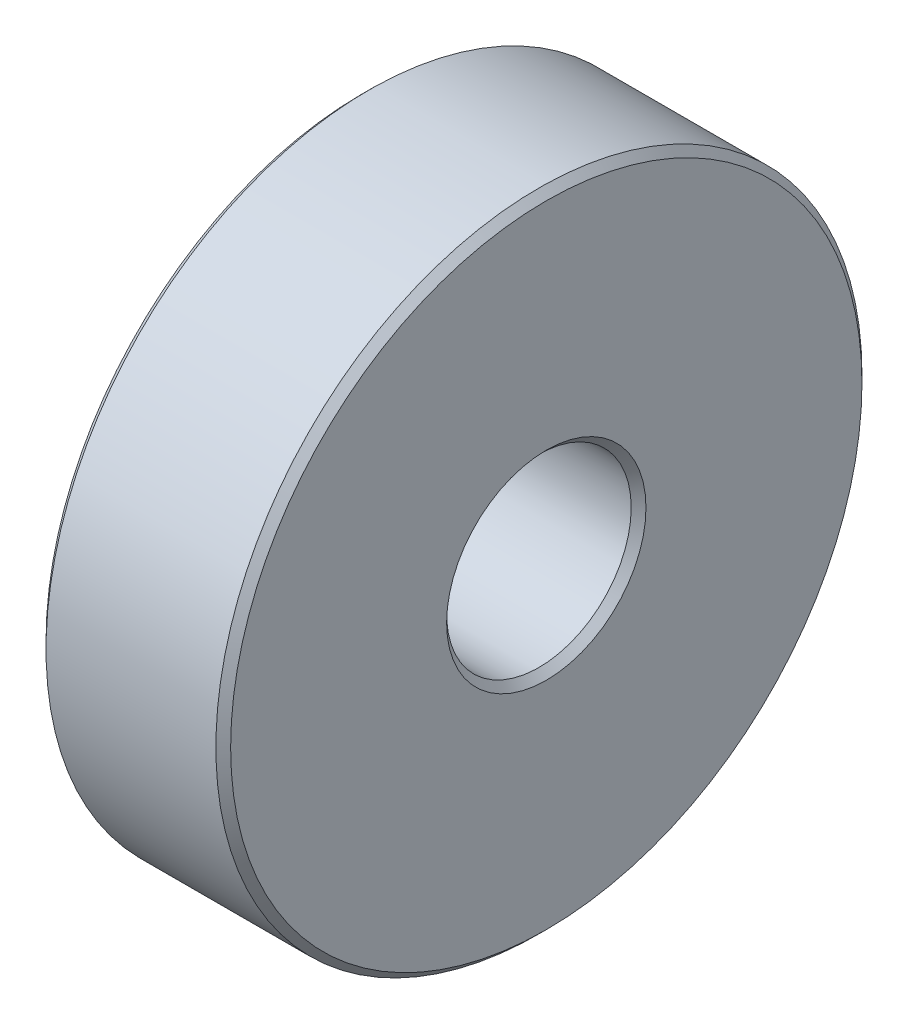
ISO-10303-21;
HEADER;
FILE_DESCRIPTION(('STEP AP214'),'2;1');
FILE_NAME('part.step','',(''),(''),'','','');
FILE_SCHEMA(('AUTOMOTIVE_DESIGN { 1 0 10303 214 1 1 1 1 }'));
ENDSEC;
DATA;
#1=APPLICATION_CONTEXT('core data for automotive mechanical design processes');
#2=APPLICATION_PROTOCOL_DEFINITION('international standard','automotive_design',2000,#1);
#3=PRODUCT_CONTEXT('',#1,'mechanical');
#4=PRODUCT('Part','Part','',(#3));
#5=PRODUCT_RELATED_PRODUCT_CATEGORY('part','',(#4));
#6=PRODUCT_DEFINITION_FORMATION('','',#4);
#7=PRODUCT_DEFINITION_CONTEXT('part definition',#1,'design');
#8=PRODUCT_DEFINITION('design','',#6,#7);
#9=PRODUCT_DEFINITION_SHAPE('','',#8);
#10=(LENGTH_UNIT() NAMED_UNIT(*) SI_UNIT(.MILLI.,.METRE.));
#11=(NAMED_UNIT(*) PLANE_ANGLE_UNIT() SI_UNIT($,.RADIAN.));
#12=(NAMED_UNIT(*) SI_UNIT($,.STERADIAN.) SOLID_ANGLE_UNIT());
#13=UNCERTAINTY_MEASURE_WITH_UNIT(LENGTH_MEASURE(1.E-05),#10,'distance_accuracy_value','');
#14=(GEOMETRIC_REPRESENTATION_CONTEXT(3) GLOBAL_UNCERTAINTY_ASSIGNED_CONTEXT((#13)) GLOBAL_UNIT_ASSIGNED_CONTEXT((#10,
#11,#12)) REPRESENTATION_CONTEXT('',''));
#15=CARTESIAN_POINT('',(0.,0.,0.));
#16=DIRECTION('',(0.,0.,1.));
#17=DIRECTION('',(1.,0.,0.));
#18=AXIS2_PLACEMENT_3D('',#15,#16,#17);
#19=CARTESIAN_POINT('',(6.35,0.,0.));
#20=DIRECTION('',(1.,0.,0.));
#21=DIRECTION('',(0.,0.,-1.));
#22=AXIS2_PLACEMENT_3D('',#19,#20,#21);
#23=PLANE('',#22);
#24=CARTESIAN_POINT('',(6.35,0.,0.));
#25=DIRECTION('',(1.,0.,0.));
#26=DIRECTION('',(0.,0.,-1.));
#27=AXIS2_PLACEMENT_3D('',#24,#25,#26);
#28=CIRCLE('',#27,3.42900000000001);
#29=CARTESIAN_POINT('',(6.35,0.,-3.42900000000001));
#30=VERTEX_POINT('',#29);
#31=EDGE_CURVE('E9',#30,#30,#28,.F.);
#32=ORIENTED_EDGE('',*,*,#31,.T.);
#33=EDGE_LOOP('',(#32));
#34=FACE_BOUND('',#33,.T.);
#35=CARTESIAN_POINT('',(6.35,0.,0.));
#36=DIRECTION('',(1.,0.,0.));
#37=DIRECTION('',(0.,0.,-1.));
#38=AXIS2_PLACEMENT_3D('',#35,#36,#37);
#39=CIRCLE('',#38,10.8585);
#40=CARTESIAN_POINT('',(6.35,0.,-10.8585));
#41=VERTEX_POINT('',#40);
#42=EDGE_CURVE('E21',#41,#41,#39,.T.);
#43=ORIENTED_EDGE('',*,*,#42,.T.);
#44=EDGE_LOOP('',(#43));
#45=FACE_BOUND('',#44,.T.);
#46=ADVANCED_FACE('F14',(#34,#45),#23,.T.);
#47=CARTESIAN_POINT('',(0.,0.,0.));
#48=DIRECTION('',(1.,0.,0.));
#49=DIRECTION('',(0.,0.,-1.));
#50=AXIS2_PLACEMENT_3D('',#47,#48,#49);
#51=PLANE('',#50);
#52=CARTESIAN_POINT('',(0.,0.,0.));
#53=DIRECTION('',(1.,0.,0.));
#54=DIRECTION('',(0.,0.,-1.));
#55=AXIS2_PLACEMENT_3D('',#52,#53,#54);
#56=CIRCLE('',#55,3.429);
#57=CARTESIAN_POINT('',(0.,0.,-3.429));
#58=VERTEX_POINT('',#57);
#59=EDGE_CURVE('E40',#58,#58,#56,.T.);
#60=ORIENTED_EDGE('',*,*,#59,.T.);
#61=EDGE_LOOP('',(#60));
#62=FACE_BOUND('',#61,.T.);
#63=CARTESIAN_POINT('',(0.,0.,0.));
#64=DIRECTION('',(1.,0.,0.));
#65=DIRECTION('',(0.,0.,-1.));
#66=AXIS2_PLACEMENT_3D('',#63,#64,#65);
#67=CIRCLE('',#66,10.8585);
#68=CARTESIAN_POINT('',(0.,0.,-10.8585));
#69=VERTEX_POINT('',#68);
#70=EDGE_CURVE('E43',#69,#69,#67,.F.);
#71=ORIENTED_EDGE('',*,*,#70,.T.);
#72=EDGE_LOOP('',(#71));
#73=FACE_BOUND('',#72,.T.);
#74=ADVANCED_FACE('F47',(#62,#73),#51,.F.);
#75=CARTESIAN_POINT('',(6.35,0.,0.));
#76=DIRECTION('',(-1.,0.,0.));
#77=DIRECTION('',(0.,0.,1.));
#78=AXIS2_PLACEMENT_3D('',#75,#76,#77);
#79=CYLINDRICAL_SURFACE('',#78,11.1125);
#80=CARTESIAN_POINT('',(0.253999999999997,0.,0.));
#81=DIRECTION('',(1.,0.,0.));
#82=DIRECTION('',(0.,0.,-1.));
#83=AXIS2_PLACEMENT_3D('',#80,#81,#82);
#84=CIRCLE('',#83,11.1125);
#85=CARTESIAN_POINT('',(0.253999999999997,0.,-11.1125));
#86=VERTEX_POINT('',#85);
#87=EDGE_CURVE('E25',#86,#86,#84,.T.);
#88=ORIENTED_EDGE('',*,*,#87,.T.);
#89=EDGE_LOOP('',(#88));
#90=FACE_BOUND('',#89,.T.);
#91=CARTESIAN_POINT('',(6.096,0.,0.));
#92=DIRECTION('',(1.,0.,0.));
#93=DIRECTION('',(0.,0.,-1.));
#94=AXIS2_PLACEMENT_3D('',#91,#92,#93);
#95=CIRCLE('',#94,11.1125);
#96=CARTESIAN_POINT('',(6.096,0.,-11.1125));
#97=VERTEX_POINT('',#96);
#98=EDGE_CURVE('E29',#97,#97,#95,.F.);
#99=ORIENTED_EDGE('',*,*,#98,.T.);
#100=EDGE_LOOP('',(#99));
#101=FACE_BOUND('',#100,.T.);
#102=ADVANCED_FACE('F57',(#90,#101),#79,.T.);
#103=CARTESIAN_POINT('',(6.35,0.,0.));
#104=DIRECTION('',(-1.,0.,0.));
#105=DIRECTION('',(0.,0.,1.));
#106=AXIS2_PLACEMENT_3D('',#103,#104,#105);
#107=CYLINDRICAL_SURFACE('',#106,3.175);
#108=CARTESIAN_POINT('',(0.254000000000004,0.,0.));
#109=DIRECTION('',(1.,0.,0.));
#110=DIRECTION('',(0.,0.,-1.));
#111=AXIS2_PLACEMENT_3D('',#108,#109,#110);
#112=CIRCLE('',#111,3.175);
#113=CARTESIAN_POINT('',(0.254000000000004,0.,-3.175));
#114=VERTEX_POINT('',#113);
#115=EDGE_CURVE('E34',#114,#114,#112,.F.);
#116=ORIENTED_EDGE('',*,*,#115,.T.);
#117=EDGE_LOOP('',(#116));
#118=FACE_BOUND('',#117,.T.);
#119=CARTESIAN_POINT('',(6.096,0.,0.));
#120=DIRECTION('',(1.,0.,0.));
#121=DIRECTION('',(0.,0.,-1.));
#122=AXIS2_PLACEMENT_3D('',#119,#120,#121);
#123=CIRCLE('',#122,3.175);
#124=CARTESIAN_POINT('',(6.096,0.,-3.175));
#125=VERTEX_POINT('',#124);
#126=EDGE_CURVE('E37',#125,#125,#123,.T.);
#127=ORIENTED_EDGE('',*,*,#126,.T.);
#128=EDGE_LOOP('',(#127));
#129=FACE_BOUND('',#128,.T.);
#130=ADVANCED_FACE('F60',(#118,#129),#107,.F.);
#131=CARTESIAN_POINT('',(0.,0.,0.));
#132=DIRECTION('',(-1.,0.,0.));
#133=DIRECTION('',(0.,0.,1.));
#134=AXIS2_PLACEMENT_3D('',#131,#132,#133);
#135=CONICAL_SURFACE('',#134,3.429,0.785398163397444);
#136=ORIENTED_EDGE('',*,*,#115,.F.);
#137=EDGE_LOOP('',(#136));
#138=FACE_BOUND('',#137,.T.);
#139=ORIENTED_EDGE('',*,*,#59,.F.);
#140=EDGE_LOOP('',(#139));
#141=FACE_BOUND('',#140,.T.);
#142=ADVANCED_FACE('F53',(#138,#141),#135,.F.);
#143=CARTESIAN_POINT('',(0.253999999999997,0.,0.));
#144=DIRECTION('',(1.,0.,0.));
#145=DIRECTION('',(0.,0.,-1.));
#146=AXIS2_PLACEMENT_3D('',#143,#144,#145);
#147=CONICAL_SURFACE('',#146,11.1125,0.785398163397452);
#148=ORIENTED_EDGE('',*,*,#70,.F.);
#149=EDGE_LOOP('',(#148));
#150=FACE_BOUND('',#149,.T.);
#151=ORIENTED_EDGE('',*,*,#87,.F.);
#152=EDGE_LOOP('',(#151));
#153=FACE_BOUND('',#152,.T.);
#154=ADVANCED_FACE('F49',(#150,#153),#147,.T.);
#155=CARTESIAN_POINT('',(6.096,0.,0.));
#156=DIRECTION('',(1.,0.,0.));
#157=DIRECTION('',(0.,0.,-1.));
#158=AXIS2_PLACEMENT_3D('',#155,#156,#157);
#159=CONICAL_SURFACE('',#158,3.175,0.785398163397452);
#160=ORIENTED_EDGE('',*,*,#31,.F.);
#161=EDGE_LOOP('',(#160));
#162=FACE_BOUND('',#161,.T.);
#163=ORIENTED_EDGE('',*,*,#126,.F.);
#164=EDGE_LOOP('',(#163));
#165=FACE_BOUND('',#164,.T.);
#166=ADVANCED_FACE('F52',(#162,#165),#159,.F.);
#167=CARTESIAN_POINT('',(6.35,0.,0.));
#168=DIRECTION('',(-1.,0.,0.));
#169=DIRECTION('',(0.,0.,1.));
#170=AXIS2_PLACEMENT_3D('',#167,#168,#169);
#171=CONICAL_SURFACE('',#170,10.8585,0.785398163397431);
#172=ORIENTED_EDGE('',*,*,#98,.F.);
#173=EDGE_LOOP('',(#172));
#174=FACE_BOUND('',#173,.T.);
#175=ORIENTED_EDGE('',*,*,#42,.F.);
#176=EDGE_LOOP('',(#175));
#177=FACE_BOUND('',#176,.T.);
#178=ADVANCED_FACE('F16',(#174,#177),#171,.T.);
#179=CLOSED_SHELL('',(#46,#74,#102,#130,#142,#154,#166,#178));
#180=MANIFOLD_SOLID_BREP('B1',#179);
#181=ADVANCED_BREP_SHAPE_REPRESENTATION('',(#18,#180),#14);
#182=SHAPE_DEFINITION_REPRESENTATION(#9,#181);
ENDSEC;
END-ISO-10303-21;
